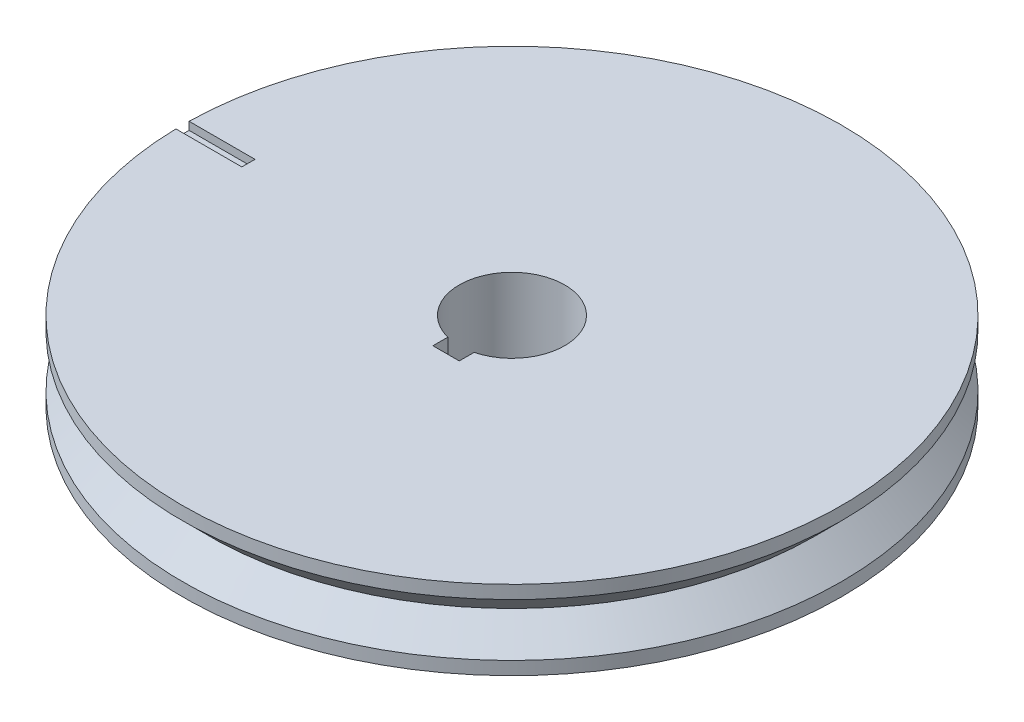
from build123d import *

# Parameters (mm, degrees)
CUT_EXTRUDE1_DEPTH = 180.30421077
CUT_EXTRUDE3_START = -3
CUT_EXTRUDE3_DEPTH = 3


with BuildPart() as part:
    # Sketch1 → Revolve1 (revolve)
    with BuildSketch(Plane.XY, mode=Mode.PRIVATE) as revolve1_sk:
        Polygon((0, 15), (125, 15), (125, 10), (115, 0), (125, -10), (125, -15), (0, -15), align=None)
    revolve(revolve1_sk.sketch.rotate(Axis((0, -15, 0), (0, -1, 0)), 180), axis=Axis((0, -15, 0), (0, -1, 0)))

    # Sketch2 → Cut-Extrude1 (cut, through all)
    with BuildSketch(Plane(origin=(0, 15, 0), x_dir=(-1, 0, 0), z_dir=(0, 1, 0))):
        with BuildLine():
            Line((-5, 19.364916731), (-5, 25))
            Line((-5, 25), (5, 25))
            Line((5, 25), (5, 19.364916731))
            ThreePointArc((5, 19.364916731), (0, -20), (-5, 19.364916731))
        make_face()
    extrude(amount=-CUT_EXTRUDE1_DEPTH, mode=Mode.SUBTRACT)

    # Sketch3 → Cut-Extrude3 (cut)
    with BuildSketch(Plane(origin=(0, 15, 0), x_dir=(-1, 0, 0), z_dir=(0, 1, 0)).offset(CUT_EXTRUDE3_START)):
        with BuildLine():
            Line((99.974997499, -2.5), (124.974997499, -2.5))
            ThreePointArc((124.974997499, -2.5), (125, 0), (124.974997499, 2.5))
            Line((124.974997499, 2.5), (99.974997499, 2.5))
            Line((99.974997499, 2.5), (99.974997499, -2.5))
        make_face()
    extrude(amount=CUT_EXTRUDE3_DEPTH, mode=Mode.SUBTRACT)


solid = part.part
